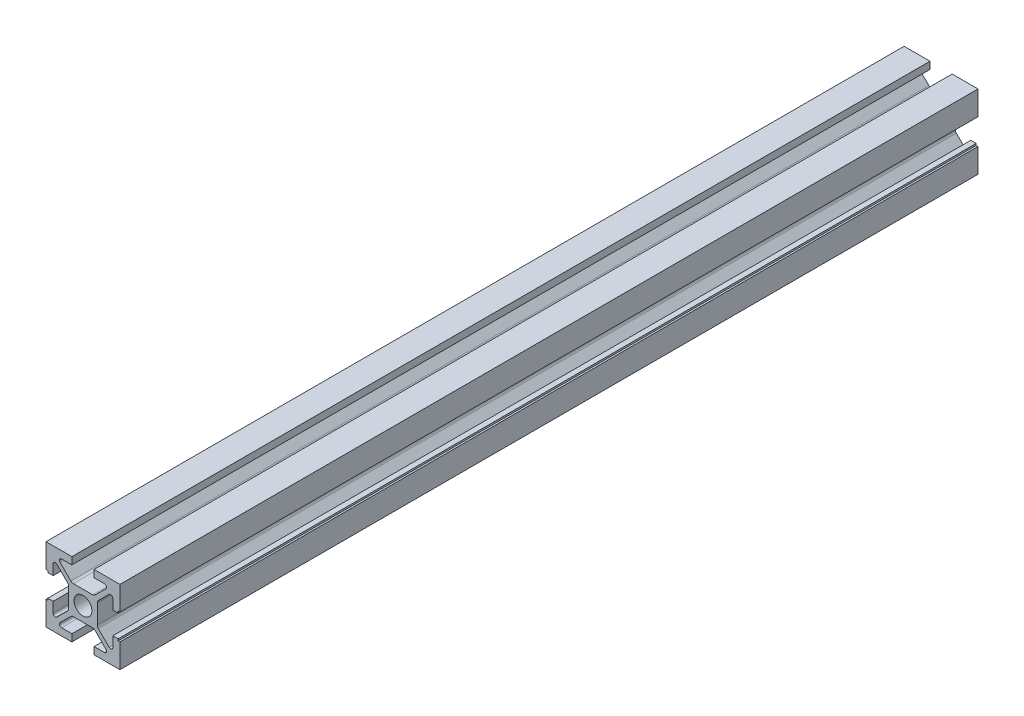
from build123d import *

# Parameters (mm, degrees)
SKETCH2_R           = 2.5
BOSS_EXTRUDE2_DEPTH = 240


with BuildPart() as part:
    # Sketch2 → Boss-Extrude2 (new body)
    with BuildSketch(Plane.XY):
        with BuildLine():
            Line((-10.33624689, -3.6), (-10.33624689, -10.33624689))
            Line((-10.33624689, -10.33624689), (-3.1, -10.33624689))
            Line((-3.1, -10.33624689), (-3.1, -8.33624689))
            Line((-3.1, -8.33624689), (-5.990764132, -8.33624689))
            ThreePointArc((-5.990764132, -8.33624689), (-6.545144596, -7.965729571), (-6.414833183, -7.311787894))
            Line((-6.414833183, -7.311787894), (-3.392837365, -4.29256834))
            ThreePointArc((-3.392837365, -4.29256834), (-3.068526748, -4.07603256), (-2.686055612, -4))
            Line((-2.686055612, -4), (2.686055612, -4))
            ThreePointArc((2.686055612, -4), (3.068526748, -4.07603256), (3.392837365, -4.29256834))
            Line((3.392837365, -4.29256834), (6.414833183, -7.311787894))
            ThreePointArc((6.414833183, -7.311787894), (6.545144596, -7.965729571), (5.990764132, -8.33624689))
            Line((5.990764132, -8.33624689), (3.1, -8.33624689))
            Line((3.1, -8.33624689), (3.1, -10.33624689))
            Line((3.1, -10.33624689), (10.33624689, -10.33624689))
            Line((10.33624689, -10.33624689), (10.33624689, -3.6))
            Line((10.33624689, -3.6), (9.83624689, -3.6))
            Line((9.83624689, -3.6), (9.83624689, -3.1))
            Line((9.83624689, -3.1), (8.33624689, -3.1))
            Line((8.33624689, -3.1), (8.33624689, -5.99013487))
            ThreePointArc((8.33624689, -5.99013487), (7.965755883, -6.544504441), (7.31182815, -6.414244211))
            Line((7.31182815, -6.414244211), (4.292635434, -3.392848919))
            ThreePointArc((4.292635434, -3.392848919), (4.076050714, -3.068515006), (4, -2.686000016))
            Line((4, -2.686000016), (4, 2.686000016))
            ThreePointArc((4, 2.686000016), (4.076050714, 3.068515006), (4.292635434, 3.392848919))
            Line((4.292635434, 3.392848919), (7.31182815, 6.414244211))
            ThreePointArc((7.31182815, 6.414244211), (7.965755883, 6.544504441), (8.33624689, 5.99013487))
            Line((8.33624689, 5.99013487), (8.33624689, 3.1))
            Line((8.33624689, 3.1), (9.83624689, 3.1))
            Line((9.83624689, 3.1), (9.83624689, 3.6))
            Line((9.83624689, 3.6), (10.33624689, 3.6))
            Line((10.33624689, 3.6), (10.33624689, 10.33624689))
            Line((10.33624689, 10.33624689), (3.1, 10.33624689))
            Line((3.1, 10.33624689), (3.1, 8.33624689))
            Line((3.1, 8.33624689), (5.990764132, 8.33624689))
            ThreePointArc((5.990764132, 8.33624689), (6.545144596, 7.965729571), (6.414833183, 7.311787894))
            Line((6.414833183, 7.311787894), (3.392837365, 4.29256834))
            ThreePointArc((3.392837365, 4.29256834), (3.068526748, 4.07603256), (2.686055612, 4))
            Line((2.686055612, 4), (-2.686055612, 4))
            ThreePointArc((-2.686055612, 4), (-3.068526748, 4.07603256), (-3.392837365, 4.29256834))
            Line((-3.392837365, 4.29256834), (-6.414833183, 7.311787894))
            ThreePointArc((-6.414833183, 7.311787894), (-6.545144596, 7.965729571), (-5.990764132, 8.33624689))
            Line((-5.990764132, 8.33624689), (-3.1, 8.33624689))
            Line((-3.1, 8.33624689), (-3.1, 10.33624689))
            Line((-3.1, 10.33624689), (-10.33624689, 10.33624689))
            Line((-10.33624689, 10.33624689), (-10.33624689, 3.6))
            Line((-10.33624689, 3.6), (-9.83624689, 3.6))
            Line((-9.83624689, 3.6), (-9.83624689, 3.1))
            Line((-9.83624689, 3.1), (-8.33624689, 3.1))
            Line((-8.33624689, 3.1), (-8.33624689, 5.99013487))
            ThreePointArc((-8.33624689, 5.99013487), (-7.965755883, 6.544504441), (-7.31182815, 6.414244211))
            Line((-7.31182815, 6.414244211), (-4.292635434, 3.392848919))
            ThreePointArc((-4.292635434, 3.392848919), (-4.076050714, 3.068515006), (-4, 2.686000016))
            Line((-4, 2.686000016), (-4, -2.686000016))
            ThreePointArc((-4, -2.686000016), (-4.076050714, -3.068515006), (-4.292635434, -3.392848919))
            Line((-4.292635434, -3.392848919), (-7.31182815, -6.414244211))
            ThreePointArc((-7.31182815, -6.414244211), (-7.965755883, -6.544504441), (-8.33624689, -5.99013487))
            Line((-8.33624689, -5.99013487), (-8.33624689, -3.1))
            Line((-8.33624689, -3.1), (-9.83624689, -3.1))
            Line((-9.83624689, -3.1), (-9.83624689, -3.6))
            Line((-9.83624689, -3.6), (-10.33624689, -3.6))
        make_face()
        Circle(SKETCH2_R, mode=Mode.SUBTRACT)
    extrude(amount=BOSS_EXTRUDE2_DEPTH)


solid = part.part
